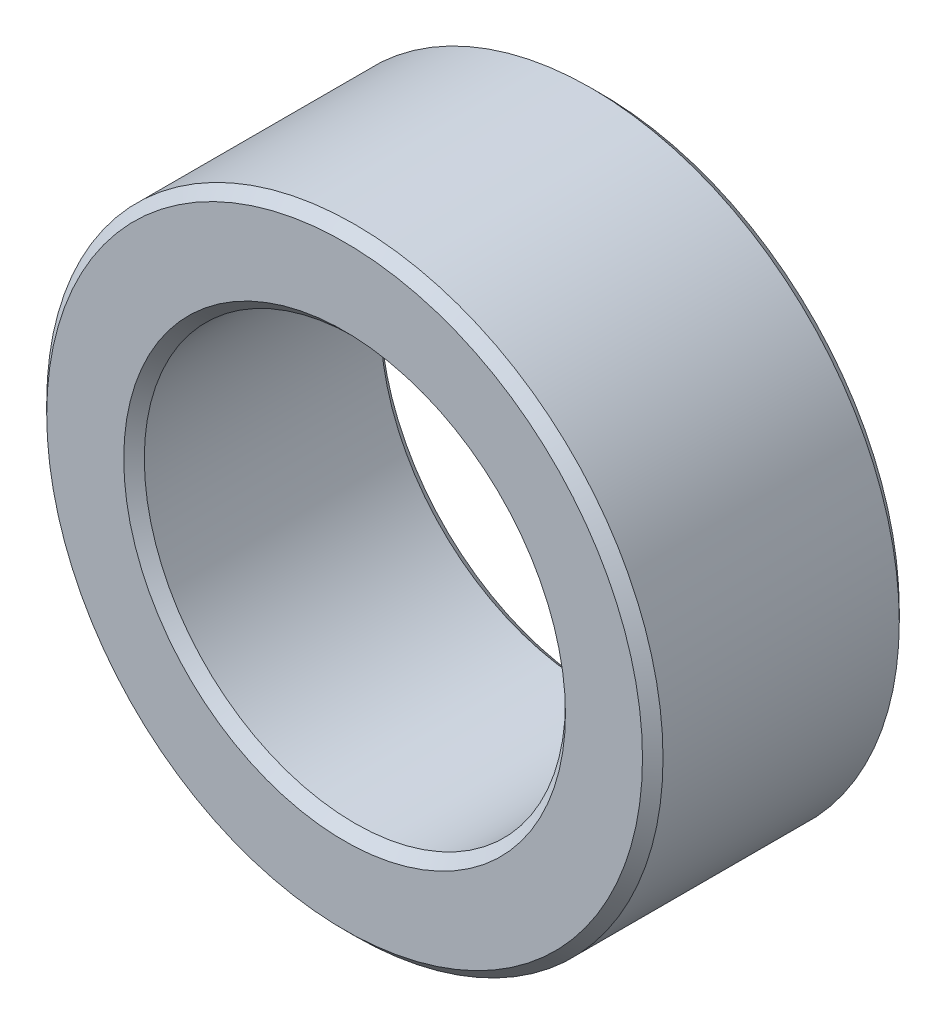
from build123d import *

# Parameters (mm, degrees)
SKETCH1_R           = 6
SKETCH1_R_2         = 4.1
BOSS_EXTRUDE2_DEPTH = 2.5
CHAMFER3_SIZE       = 0.2


with BuildPart() as part:
    # Sketch1 → Boss-Extrude2 (new, symmetric)
    with BuildSketch(Plane.XY):
        Circle(SKETCH1_R)
        Circle(SKETCH1_R_2, mode=Mode.SUBTRACT)
    extrude(amount=BOSS_EXTRUDE2_DEPTH, both=True)

    # Chamfer3
    chamfer3_edges = [part.edges().sort_by_distance(p)[0] for p in [
        (-6, 0, -2.5),
        (-6, 0, 2.5),
        (-4.1, 0, -2.5),
        (-4.1, 0, 2.5),
    ]]
    chamfer(chamfer3_edges, length=CHAMFER3_SIZE)


solid = part.part
